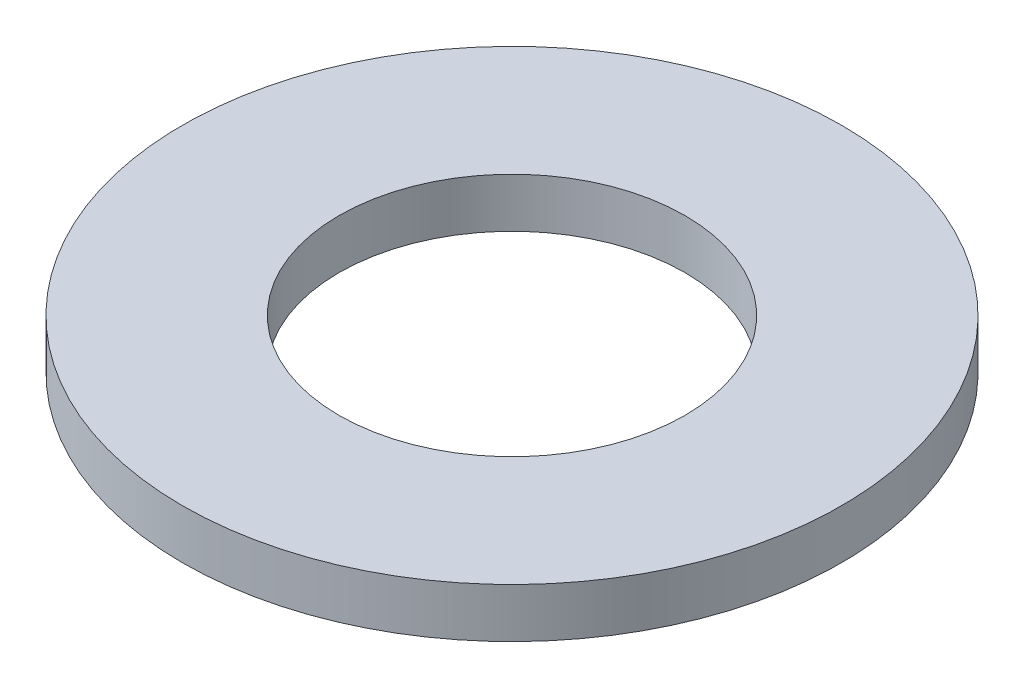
from build123d import *

# Parameters (mm, degrees)
ESQUISSE1_W = 9.5
ESQUISSE1_H = 3


with BuildPart() as part:
    # Esquisse1 → Base (revolve)
    with BuildSketch(Plane.XY, mode=Mode.PRIVATE) as base_sk:
        with Locations((15.25, 1.5)):
            Rectangle(ESQUISSE1_W, ESQUISSE1_H)
    revolve(base_sk.sketch.rotate(Axis((0, 0, 0), (0, 1, 0)), 90), axis=Axis((0, 0, 0), (0, 1, 0)))


solid = part.part
